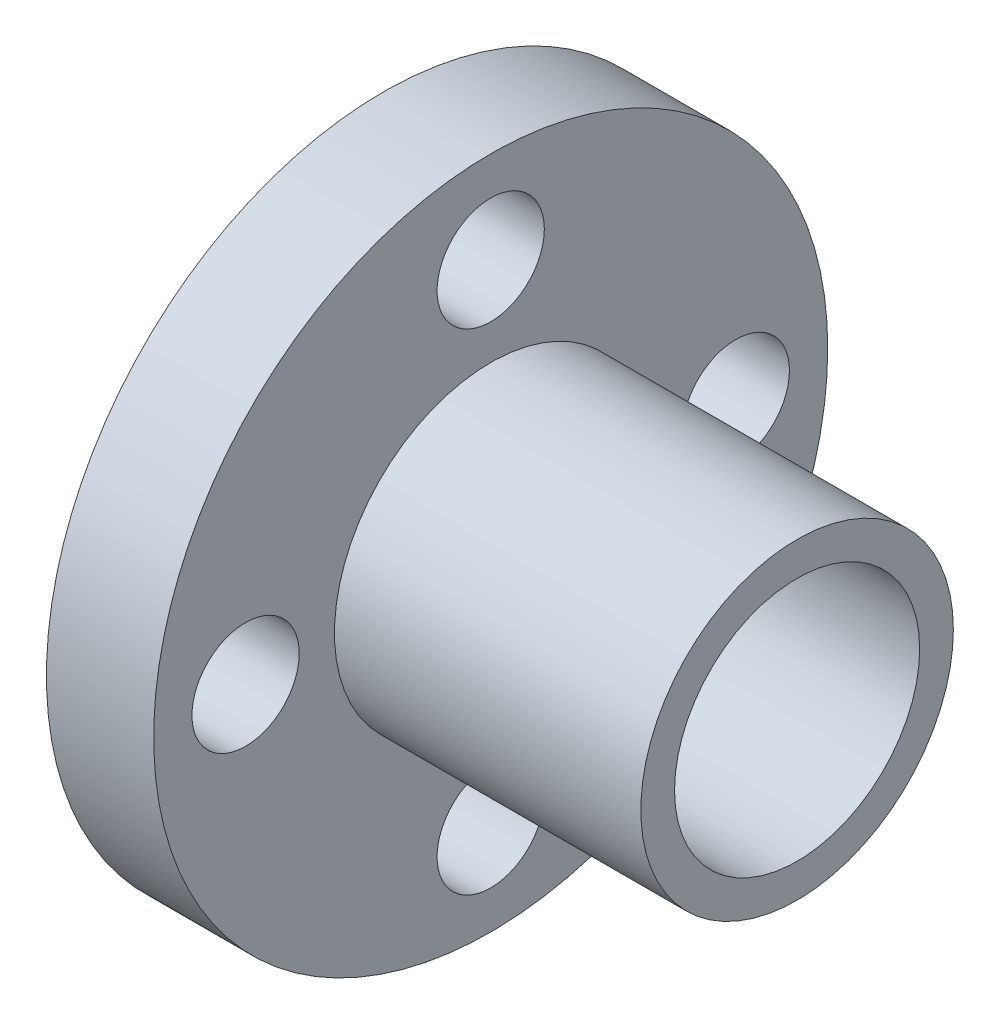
from build123d import *

# Parameters (mm, degrees)
SKETCH1_R                = 11
SKETCH1_R_2              = 5.1
SKETCH1_R_3              = 1.75
BOSS_EXTRUDE1_DEPTH      = 3.5
BOSS_EXTRUDE2_DEPTH      = 10
BOSS_EXTRUDE2_DEPTH_BACK = 5
SKETCH2_R                = 5.1
SKETCH2_R_2              = 4


with BuildPart() as part:
    # Sketch1 → Boss-Extrude1 (new body)
    with BuildSketch(Plane(origin=(0, 0, 0), x_dir=(0, 0, -1), z_dir=(1, 0, 0))):
        Circle(SKETCH1_R)
        Circle(SKETCH1_R_2, mode=Mode.SUBTRACT)
        with Locations((0, 8)):
            Circle(SKETCH1_R_3, mode=Mode.SUBTRACT)
        with Locations((8, 0)):
            Circle(SKETCH1_R_3, mode=Mode.SUBTRACT)
        with Locations((0, -8)):
            Circle(SKETCH1_R_3, mode=Mode.SUBTRACT)
        with Locations((-8, 0)):
            Circle(SKETCH1_R_3, mode=Mode.SUBTRACT)
    extrude(amount=BOSS_EXTRUDE1_DEPTH)

    # Sketch2 → Boss-Extrude2 (add, two sides: drawn at the far end of the back side and taken through both)
    with BuildSketch(Plane(origin=(3.5, 0, 0), x_dir=(0, 0, -1), z_dir=(1, 0, 0)).offset(-BOSS_EXTRUDE2_DEPTH_BACK)):
        Circle(SKETCH2_R)
        Circle(SKETCH2_R_2, mode=Mode.SUBTRACT)
    extrude(amount=BOSS_EXTRUDE2_DEPTH + BOSS_EXTRUDE2_DEPTH_BACK)


solid = part.part
